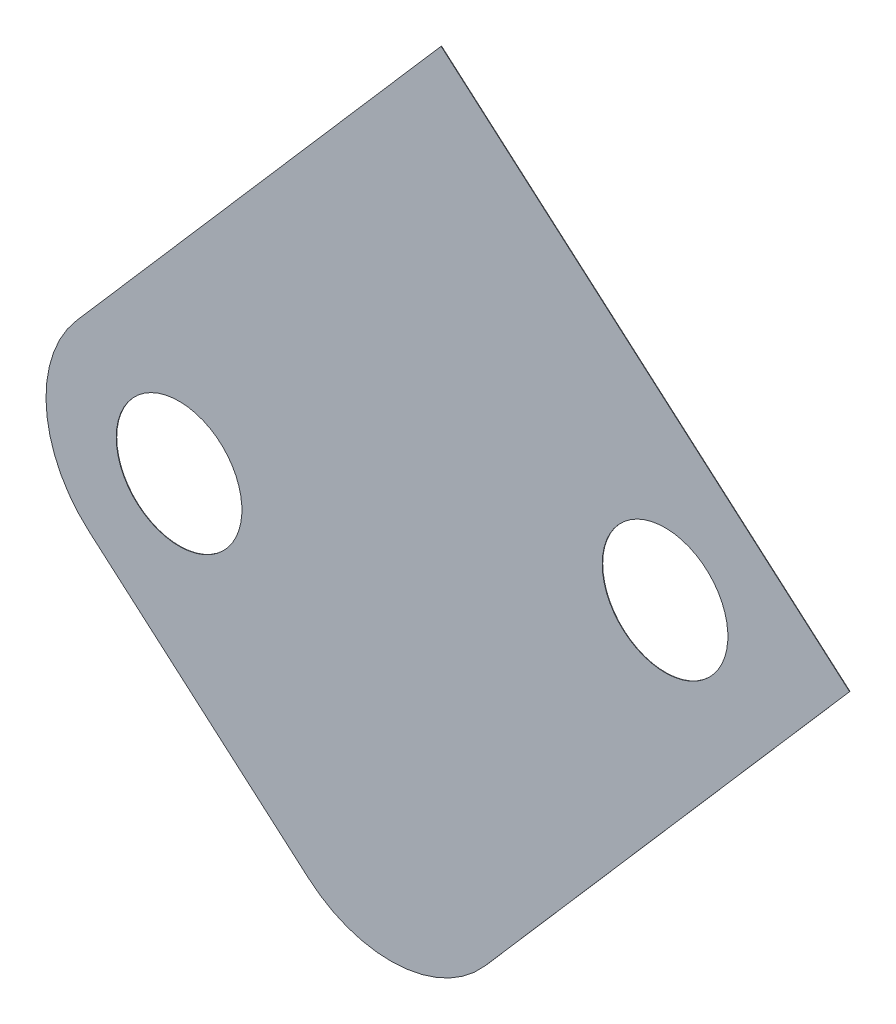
ISO-10303-21;
HEADER;
FILE_DESCRIPTION(('STEP AP214'),'2;1');
FILE_NAME('part.step','',(''),(''),'','','');
FILE_SCHEMA(('AUTOMOTIVE_DESIGN { 1 0 10303 214 1 1 1 1 }'));
ENDSEC;
DATA;
#1=APPLICATION_CONTEXT('core data for automotive mechanical design processes');
#2=APPLICATION_PROTOCOL_DEFINITION('international standard','automotive_design',2000,#1);
#3=PRODUCT_CONTEXT('',#1,'mechanical');
#4=PRODUCT('Part','Part','',(#3));
#5=PRODUCT_RELATED_PRODUCT_CATEGORY('part','',(#4));
#6=PRODUCT_DEFINITION_FORMATION('','',#4);
#7=PRODUCT_DEFINITION_CONTEXT('part definition',#1,'design');
#8=PRODUCT_DEFINITION('design','',#6,#7);
#9=PRODUCT_DEFINITION_SHAPE('','',#8);
#10=(LENGTH_UNIT() NAMED_UNIT(*) SI_UNIT(.MILLI.,.METRE.));
#11=(NAMED_UNIT(*) PLANE_ANGLE_UNIT() SI_UNIT($,.RADIAN.));
#12=(NAMED_UNIT(*) SI_UNIT($,.STERADIAN.) SOLID_ANGLE_UNIT());
#13=UNCERTAINTY_MEASURE_WITH_UNIT(LENGTH_MEASURE(1.E-05),#10,'distance_accuracy_value','');
#14=(GEOMETRIC_REPRESENTATION_CONTEXT(3) GLOBAL_UNCERTAINTY_ASSIGNED_CONTEXT((#13)) GLOBAL_UNIT_ASSIGNED_CONTEXT((#10,
#11,#12)) REPRESENTATION_CONTEXT('',''));
#15=CARTESIAN_POINT('',(0.,0.,0.));
#16=DIRECTION('',(0.,0.,1.));
#17=DIRECTION('',(1.,0.,0.));
#18=AXIS2_PLACEMENT_3D('',#15,#16,#17);
#19=CARTESIAN_POINT('',(-682.910085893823,-108.748616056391,0.0253999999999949));
#20=DIRECTION('',(-0.755030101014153,0.655690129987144,0.));
#21=DIRECTION('',(-0.655690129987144,-0.755030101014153,0.));
#22=AXIS2_PLACEMENT_3D('',#19,#20,#21);
#23=PLANE('',#22);
#24=DIRECTION('',(0.655690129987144,0.755030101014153,0.));
#25=VECTOR('',#24,1.);
#26=CARTESIAN_POINT('',(-682.910085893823,-108.748616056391,0.));
#27=LINE('',#26,#25);
#28=CARTESIAN_POINT('',(-682.910085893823,-108.748616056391,0.));
#29=VERTEX_POINT('',#28);
#30=CARTESIAN_POINT('',(-662.205965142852,-84.9077289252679,0.));
#31=VERTEX_POINT('',#30);
#32=EDGE_CURVE('E135',#29,#31,#27,.T.);
#33=ORIENTED_EDGE('',*,*,#32,.T.);
#34=DIRECTION('',(0.,0.,-1.));
#35=VECTOR('',#34,1.);
#36=CARTESIAN_POINT('',(-662.205965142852,-84.9077289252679,0.0253999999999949));
#37=LINE('',#36,#35);
#38=CARTESIAN_POINT('',(-662.205965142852,-84.9077289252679,0.0253999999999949));
#39=VERTEX_POINT('',#38);
#40=EDGE_CURVE('E11',#39,#31,#37,.T.);
#41=ORIENTED_EDGE('',*,*,#40,.F.);
#42=DIRECTION('',(0.655690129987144,0.755030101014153,0.));
#43=VECTOR('',#42,1.);
#44=CARTESIAN_POINT('',(-682.910085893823,-108.748616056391,0.0253999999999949));
#45=LINE('',#44,#43);
#46=CARTESIAN_POINT('',(-682.910085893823,-108.748616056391,0.0253999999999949));
#47=VERTEX_POINT('',#46);
#48=EDGE_CURVE('E152',#47,#39,#45,.T.);
#49=ORIENTED_EDGE('',*,*,#48,.F.);
#50=DIRECTION('',(0.,0.,-1.));
#51=VECTOR('',#50,1.);
#52=CARTESIAN_POINT('',(-682.910085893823,-108.748616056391,0.0253999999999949));
#53=LINE('',#52,#51);
#54=EDGE_CURVE('E131',#47,#29,#53,.T.);
#55=ORIENTED_EDGE('',*,*,#54,.T.);
#56=EDGE_LOOP('',(#33,#41,#49,#55));
#57=FACE_BOUND('',#56,.T.);
#58=ADVANCED_FACE('F45',(#57),#23,.F.);
#59=CARTESIAN_POINT('',(-662.205965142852,-84.9077289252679,0.0253999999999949));
#60=DIRECTION('',(-0.655690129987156,-0.755030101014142,0.));
#61=DIRECTION('',(0.755030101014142,-0.655690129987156,0.));
#62=AXIS2_PLACEMENT_3D('',#59,#60,#61);
#63=PLANE('',#62);
#64=DIRECTION('',(-0.755030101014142,0.655690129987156,0.));
#65=VECTOR('',#64,1.);
#66=CARTESIAN_POINT('',(-662.205965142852,-84.9077289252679,0.));
#67=LINE('',#66,#65);
#68=CARTESIAN_POINT('',(-685.411060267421,-64.7557484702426,0.));
#69=VERTEX_POINT('',#68);
#70=EDGE_CURVE('E139',#31,#69,#67,.T.);
#71=ORIENTED_EDGE('',*,*,#70,.T.);
#72=DIRECTION('',(0.,0.,-1.));
#73=VECTOR('',#72,1.);
#74=CARTESIAN_POINT('',(-685.411060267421,-64.7557484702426,0.0253999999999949));
#75=LINE('',#74,#73);
#76=CARTESIAN_POINT('',(-685.411060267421,-64.7557484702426,0.0253999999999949));
#77=VERTEX_POINT('',#76);
#78=EDGE_CURVE('E54',#77,#69,#75,.T.);
#79=ORIENTED_EDGE('',*,*,#78,.F.);
#80=DIRECTION('',(-0.755030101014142,0.655690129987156,0.));
#81=VECTOR('',#80,1.);
#82=CARTESIAN_POINT('',(-662.205965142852,-84.9077289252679,0.0253999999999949));
#83=LINE('',#82,#81);
#84=EDGE_CURVE('E99',#39,#77,#83,.T.);
#85=ORIENTED_EDGE('',*,*,#84,.F.);
#86=ORIENTED_EDGE('',*,*,#40,.T.);
#87=EDGE_LOOP('',(#71,#79,#85,#86));
#88=FACE_BOUND('',#87,.T.);
#89=ADVANCED_FACE('F182',(#88),#63,.F.);
#90=CARTESIAN_POINT('',(-685.411060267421,-64.7557484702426,0.0253999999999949));
#91=DIRECTION('',(0.755030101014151,-0.655690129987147,0.));
#92=DIRECTION('',(0.655690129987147,0.755030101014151,0.));
#93=AXIS2_PLACEMENT_3D('',#90,#91,#92);
#94=PLANE('',#93);
#95=DIRECTION('',(-0.655690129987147,-0.755030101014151,0.));
#96=VECTOR('',#95,1.);
#97=CARTESIAN_POINT('',(-685.411060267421,-64.7557484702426,0.));
#98=LINE('',#97,#96);
#99=CARTESIAN_POINT('',(-706.115181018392,-88.5966356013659,0.));
#100=VERTEX_POINT('',#99);
#101=EDGE_CURVE('E143',#69,#100,#98,.T.);
#102=ORIENTED_EDGE('',*,*,#101,.T.);
#103=DIRECTION('',(0.,0.,-1.));
#104=VECTOR('',#103,1.);
#105=CARTESIAN_POINT('',(-706.115181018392,-88.5966356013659,0.0253999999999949));
#106=LINE('',#105,#104);
#107=CARTESIAN_POINT('',(-706.115181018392,-88.5966356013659,0.0253999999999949));
#108=VERTEX_POINT('',#107);
#109=EDGE_CURVE('E123',#108,#100,#106,.T.);
#110=ORIENTED_EDGE('',*,*,#109,.F.);
#111=DIRECTION('',(-0.655690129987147,-0.755030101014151,0.));
#112=VECTOR('',#111,1.);
#113=CARTESIAN_POINT('',(-685.411060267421,-64.7557484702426,0.0253999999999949));
#114=LINE('',#113,#112);
#115=EDGE_CURVE('E112',#77,#108,#114,.T.);
#116=ORIENTED_EDGE('',*,*,#115,.F.);
#117=ORIENTED_EDGE('',*,*,#78,.T.);
#118=EDGE_LOOP('',(#102,#110,#116,#117));
#119=FACE_BOUND('',#118,.T.);
#120=ADVANCED_FACE('F163',(#119),#94,.F.);
#121=CARTESIAN_POINT('',(-700.745406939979,-93.2599038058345,0.0253999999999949));
#122=DIRECTION('',(0.,0.,-1.));
#123=DIRECTION('',(-1.,0.,0.));
#124=AXIS2_PLACEMENT_3D('',#121,#122,#123);
#125=CYLINDRICAL_SURFACE('',#124,7.11200000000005);
#126=CARTESIAN_POINT('',(-700.745406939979,-93.2599038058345,0.));
#127=DIRECTION('',(0.,0.,1.));
#128=DIRECTION('',(1.,0.,0.));
#129=AXIS2_PLACEMENT_3D('',#126,#127,#128);
#130=CIRCLE('',#129,7.11200000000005);
#131=CARTESIAN_POINT('',(-705.408675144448,-98.6296778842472,0.));
#132=VERTEX_POINT('',#131);
#133=EDGE_CURVE('E121',#100,#132,#130,.T.);
#134=ORIENTED_EDGE('',*,*,#133,.T.);
#135=DIRECTION('',(0.,0.,-1.));
#136=VECTOR('',#135,1.);
#137=CARTESIAN_POINT('',(-705.408675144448,-98.6296778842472,0.0253999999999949));
#138=LINE('',#137,#136);
#139=CARTESIAN_POINT('',(-705.408675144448,-98.6296778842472,0.0253999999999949));
#140=VERTEX_POINT('',#139);
#141=EDGE_CURVE('E118',#140,#132,#138,.T.);
#142=ORIENTED_EDGE('',*,*,#141,.F.);
#143=CARTESIAN_POINT('',(-700.745406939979,-93.2599038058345,0.0253999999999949));
#144=DIRECTION('',(0.,0.,1.));
#145=DIRECTION('',(1.,0.,0.));
#146=AXIS2_PLACEMENT_3D('',#143,#144,#145);
#147=CIRCLE('',#146,7.11200000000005);
#148=EDGE_CURVE('E106',#108,#140,#147,.T.);
#149=ORIENTED_EDGE('',*,*,#148,.F.);
#150=ORIENTED_EDGE('',*,*,#109,.T.);
#151=EDGE_LOOP('',(#134,#142,#149,#150));
#152=FACE_BOUND('',#151,.T.);
#153=ADVANCED_FACE('F119',(#152),#125,.T.);
#154=CARTESIAN_POINT('',(-705.408675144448,-98.6296778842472,0.0253999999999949));
#155=DIRECTION('',(0.655690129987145,0.755030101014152,0.));
#156=DIRECTION('',(-0.755030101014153,0.655690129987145,0.));
#157=AXIS2_PLACEMENT_3D('',#154,#155,#156);
#158=PLANE('',#157);
#159=DIRECTION('',(0.755030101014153,-0.655690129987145,0.));
#160=VECTOR('',#159,1.);
#161=CARTESIAN_POINT('',(-705.408675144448,-98.6296778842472,0.));
#162=LINE('',#161,#160);
#163=CARTESIAN_POINT('',(-692.943128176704,-109.455121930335,0.));
#164=VERTEX_POINT('',#163);
#165=EDGE_CURVE('E85',#132,#164,#162,.T.);
#166=ORIENTED_EDGE('',*,*,#165,.T.);
#167=DIRECTION('',(0.,0.,-1.));
#168=VECTOR('',#167,1.);
#169=CARTESIAN_POINT('',(-692.943128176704,-109.455121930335,0.0253999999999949));
#170=LINE('',#169,#168);
#171=CARTESIAN_POINT('',(-692.943128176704,-109.455121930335,0.0253999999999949));
#172=VERTEX_POINT('',#171);
#173=EDGE_CURVE('E124',#172,#164,#170,.T.);
#174=ORIENTED_EDGE('',*,*,#173,.F.);
#175=DIRECTION('',(0.755030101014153,-0.655690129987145,0.));
#176=VECTOR('',#175,1.);
#177=CARTESIAN_POINT('',(-705.408675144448,-98.6296778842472,0.0253999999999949));
#178=LINE('',#177,#176);
#179=EDGE_CURVE('E110',#140,#172,#178,.T.);
#180=ORIENTED_EDGE('',*,*,#179,.F.);
#181=ORIENTED_EDGE('',*,*,#141,.T.);
#182=EDGE_LOOP('',(#166,#174,#180,#181));
#183=FACE_BOUND('',#182,.T.);
#184=ADVANCED_FACE('F126',(#183),#158,.F.);
#185=CARTESIAN_POINT('',(-688.279859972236,-104.085347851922,0.0253999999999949));
#186=DIRECTION('',(0.,0.,-1.));
#187=DIRECTION('',(-1.,0.,0.));
#188=AXIS2_PLACEMENT_3D('',#185,#186,#187);
#189=CYLINDRICAL_SURFACE('',#188,7.11200000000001);
#190=CARTESIAN_POINT('',(-688.279859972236,-104.085347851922,0.));
#191=DIRECTION('',(0.,0.,1.));
#192=DIRECTION('',(1.,0.,0.));
#193=AXIS2_PLACEMENT_3D('',#190,#191,#192);
#194=CIRCLE('',#193,7.11200000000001);
#195=EDGE_CURVE('E91',#164,#29,#194,.T.);
#196=ORIENTED_EDGE('',*,*,#195,.T.);
#197=ORIENTED_EDGE('',*,*,#54,.F.);
#198=CARTESIAN_POINT('',(-688.279859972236,-104.085347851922,0.0253999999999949));
#199=DIRECTION('',(0.,0.,1.));
#200=DIRECTION('',(1.,0.,0.));
#201=AXIS2_PLACEMENT_3D('',#198,#199,#200);
#202=CIRCLE('',#201,7.11200000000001);
#203=EDGE_CURVE('E62',#172,#47,#202,.T.);
#204=ORIENTED_EDGE('',*,*,#203,.F.);
#205=ORIENTED_EDGE('',*,*,#173,.T.);
#206=EDGE_LOOP('',(#196,#197,#204,#205));
#207=FACE_BOUND('',#206,.T.);
#208=ADVANCED_FACE('F170',(#207),#189,.T.);
#209=CARTESIAN_POINT('',(-700.745406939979,-93.2599038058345,0.0253999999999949));
#210=DIRECTION('',(0.,0.,1.));
#211=DIRECTION('',(1.,0.,0.));
#212=AXIS2_PLACEMENT_3D('',#209,#210,#211);
#213=PLANE('',#212);
#214=CARTESIAN_POINT('',(-672.686911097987,-85.6457752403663,0.0253999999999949));
#215=DIRECTION('',(0.,0.,-1.));
#216=DIRECTION('',(-1.,0.,0.));
#217=AXIS2_PLACEMENT_3D('',#214,#215,#216);
#218=CIRCLE('',#217,3.56869999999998);
#219=CARTESIAN_POINT('',(-676.255611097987,-85.6457752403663,0.0253999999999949));
#220=VERTEX_POINT('',#219);
#221=EDGE_CURVE('E250',#220,#220,#218,.T.);
#222=ORIENTED_EDGE('',*,*,#221,.T.);
#223=EDGE_LOOP('',(#222));
#224=FACE_BOUND('',#223,.T.);
#225=CARTESIAN_POINT('',(-700.297503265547,-93.2283633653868,0.0253999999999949));
#226=DIRECTION('',(0.,0.,-1.));
#227=DIRECTION('',(-1.,0.,0.));
#228=AXIS2_PLACEMENT_3D('',#225,#226,#227);
#229=CIRCLE('',#228,3.56869999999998);
#230=CARTESIAN_POINT('',(-703.866203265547,-93.2283633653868,0.0253999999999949));
#231=VERTEX_POINT('',#230);
#232=EDGE_CURVE('E255',#231,#231,#229,.T.);
#233=ORIENTED_EDGE('',*,*,#232,.T.);
#234=EDGE_LOOP('',(#233));
#235=FACE_BOUND('',#234,.T.);
#236=ORIENTED_EDGE('',*,*,#48,.T.);
#237=ORIENTED_EDGE('',*,*,#84,.T.);
#238=ORIENTED_EDGE('',*,*,#115,.T.);
#239=ORIENTED_EDGE('',*,*,#148,.T.);
#240=ORIENTED_EDGE('',*,*,#179,.T.);
#241=ORIENTED_EDGE('',*,*,#203,.T.);
#242=EDGE_LOOP('',(#236,#237,#238,#239,#240,#241));
#243=FACE_BOUND('',#242,.T.);
#244=ADVANCED_FACE('F108',(#224,#235,#243),#213,.T.);
#245=CARTESIAN_POINT('',(-700.745406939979,-93.2599038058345,0.));
#246=DIRECTION('',(0.,0.,1.));
#247=DIRECTION('',(1.,0.,0.));
#248=AXIS2_PLACEMENT_3D('',#245,#246,#247);
#249=PLANE('',#248);
#250=CARTESIAN_POINT('',(-672.686911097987,-85.6457752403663,0.));
#251=DIRECTION('',(0.,0.,-1.));
#252=DIRECTION('',(-1.,0.,0.));
#253=AXIS2_PLACEMENT_3D('',#250,#251,#252);
#254=CIRCLE('',#253,3.56869999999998);
#255=CARTESIAN_POINT('',(-676.255611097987,-85.6457752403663,0.));
#256=VERTEX_POINT('',#255);
#257=EDGE_CURVE('E253',#256,#256,#254,.T.);
#258=ORIENTED_EDGE('',*,*,#257,.F.);
#259=EDGE_LOOP('',(#258));
#260=FACE_BOUND('',#259,.T.);
#261=CARTESIAN_POINT('',(-700.297503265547,-93.2283633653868,0.));
#262=DIRECTION('',(0.,0.,-1.));
#263=DIRECTION('',(-1.,0.,0.));
#264=AXIS2_PLACEMENT_3D('',#261,#262,#263);
#265=CIRCLE('',#264,3.56869999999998);
#266=CARTESIAN_POINT('',(-703.866203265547,-93.2283633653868,0.));
#267=VERTEX_POINT('',#266);
#268=EDGE_CURVE('E140',#267,#267,#265,.T.);
#269=ORIENTED_EDGE('',*,*,#268,.F.);
#270=EDGE_LOOP('',(#269));
#271=FACE_BOUND('',#270,.T.);
#272=ORIENTED_EDGE('',*,*,#32,.F.);
#273=ORIENTED_EDGE('',*,*,#195,.F.);
#274=ORIENTED_EDGE('',*,*,#165,.F.);
#275=ORIENTED_EDGE('',*,*,#133,.F.);
#276=ORIENTED_EDGE('',*,*,#101,.F.);
#277=ORIENTED_EDGE('',*,*,#70,.F.);
#278=EDGE_LOOP('',(#272,#273,#274,#275,#276,#277));
#279=FACE_BOUND('',#278,.T.);
#280=ADVANCED_FACE('F166',(#260,#271,#279),#249,.F.);
#281=CARTESIAN_POINT('',(-700.297503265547,-93.2283633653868,0.));
#282=DIRECTION('',(0.,0.,-1.));
#283=DIRECTION('',(-1.,0.,0.));
#284=AXIS2_PLACEMENT_3D('',#281,#282,#283);
#285=CYLINDRICAL_SURFACE('',#284,3.56869999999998);
#286=ORIENTED_EDGE('',*,*,#232,.F.);
#287=EDGE_LOOP('',(#286));
#288=FACE_BOUND('',#287,.T.);
#289=ORIENTED_EDGE('',*,*,#268,.T.);
#290=EDGE_LOOP('',(#289));
#291=FACE_BOUND('',#290,.T.);
#292=ADVANCED_FACE('F221',(#288,#291),#285,.F.);
#293=CARTESIAN_POINT('',(-672.686911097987,-85.6457752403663,0.));
#294=DIRECTION('',(0.,0.,-1.));
#295=DIRECTION('',(-1.,0.,0.));
#296=AXIS2_PLACEMENT_3D('',#293,#294,#295);
#297=CYLINDRICAL_SURFACE('',#296,3.56869999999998);
#298=ORIENTED_EDGE('',*,*,#221,.F.);
#299=EDGE_LOOP('',(#298));
#300=FACE_BOUND('',#299,.T.);
#301=ORIENTED_EDGE('',*,*,#257,.T.);
#302=EDGE_LOOP('',(#301));
#303=FACE_BOUND('',#302,.T.);
#304=ADVANCED_FACE('F231',(#300,#303),#297,.F.);
#305=CLOSED_SHELL('',(#58,#89,#120,#153,#184,#208,#244,#280,#292,#304));
#306=MANIFOLD_SOLID_BREP('B2',#305);
#307=ADVANCED_BREP_SHAPE_REPRESENTATION('',(#18,#306),#14);
#308=SHAPE_DEFINITION_REPRESENTATION(#9,#307);
ENDSEC;
END-ISO-10303-21;
